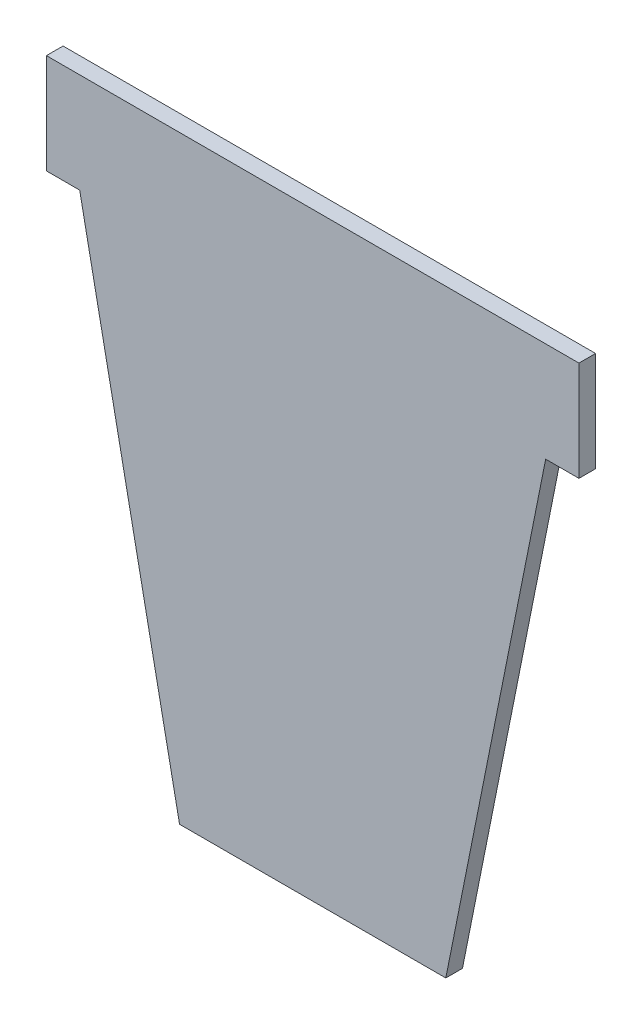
from build123d import *

# Parameters (mm, degrees)
BOSS_EXTRUDE1_DEPTH = 6.35


with BuildPart() as part:
    # Sketch2 → Boss-Extrude1 (new body)
    with BuildSketch(Plane.XY):
        Polygon((0, 0), (203.2, 0), (203.2, -38.1), (190.5, -38.1), (152.4, -228.6), (50.8, -228.6), (12.7, -38.1), (0, -38.1), align=None)
    extrude(amount=BOSS_EXTRUDE1_DEPTH)


solid = part.part
